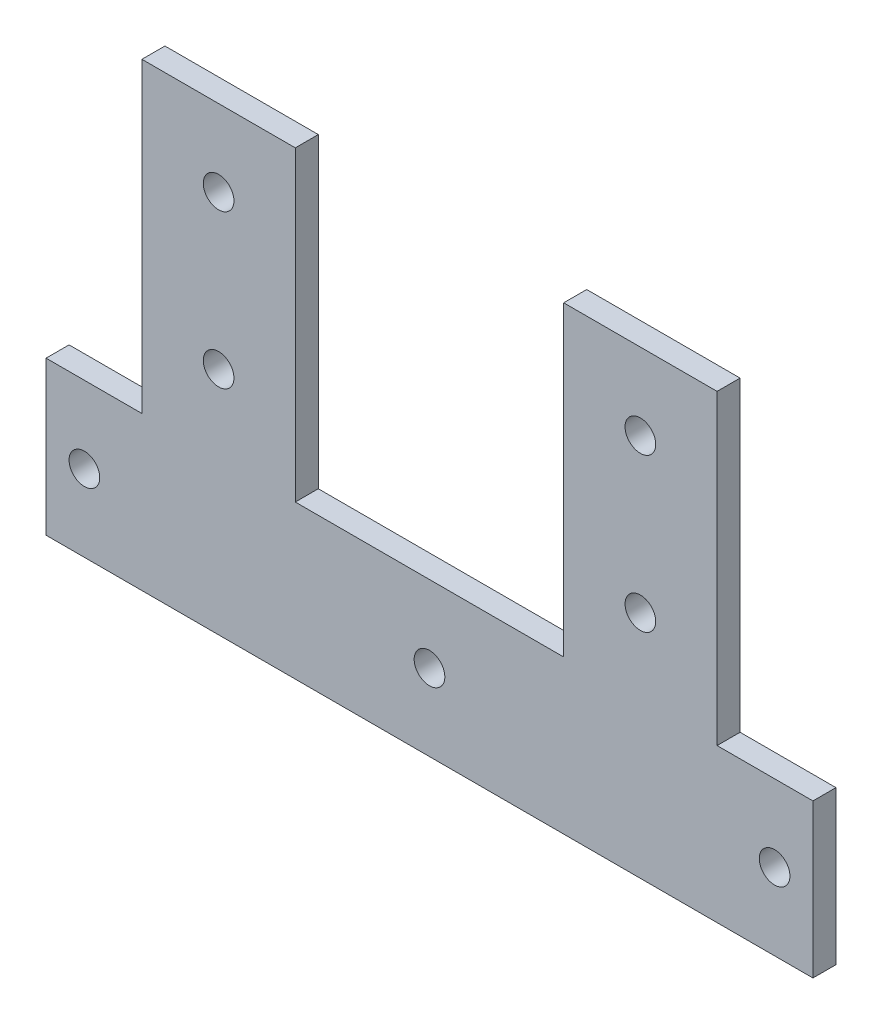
ISO-10303-21;
HEADER;
FILE_DESCRIPTION(('STEP AP214'),'2;1');
FILE_NAME('part.step','',(''),(''),'','','');
FILE_SCHEMA(('AUTOMOTIVE_DESIGN { 1 0 10303 214 1 1 1 1 }'));
ENDSEC;
DATA;
#1=APPLICATION_CONTEXT('core data for automotive mechanical design processes');
#2=APPLICATION_PROTOCOL_DEFINITION('international standard','automotive_design',2000,#1);
#3=PRODUCT_CONTEXT('',#1,'mechanical');
#4=PRODUCT('Part','Part','',(#3));
#5=PRODUCT_RELATED_PRODUCT_CATEGORY('part','',(#4));
#6=PRODUCT_DEFINITION_FORMATION('','',#4);
#7=PRODUCT_DEFINITION_CONTEXT('part definition',#1,'design');
#8=PRODUCT_DEFINITION('design','',#6,#7);
#9=PRODUCT_DEFINITION_SHAPE('','',#8);
#10=(LENGTH_UNIT() NAMED_UNIT(*) SI_UNIT(.MILLI.,.METRE.));
#11=(NAMED_UNIT(*) PLANE_ANGLE_UNIT() SI_UNIT($,.RADIAN.));
#12=(NAMED_UNIT(*) SI_UNIT($,.STERADIAN.) SOLID_ANGLE_UNIT());
#13=UNCERTAINTY_MEASURE_WITH_UNIT(LENGTH_MEASURE(1.E-05),#10,'distance_accuracy_value','');
#14=(GEOMETRIC_REPRESENTATION_CONTEXT(3) GLOBAL_UNCERTAINTY_ASSIGNED_CONTEXT((#13)) GLOBAL_UNIT_ASSIGNED_CONTEXT((#10,
#11,#12)) REPRESENTATION_CONTEXT('',''));
#15=CARTESIAN_POINT('',(0.,0.,0.));
#16=DIRECTION('',(0.,0.,1.));
#17=DIRECTION('',(1.,0.,0.));
#18=AXIS2_PLACEMENT_3D('',#15,#16,#17);
#19=CARTESIAN_POINT('',(50.,10.,3.));
#20=DIRECTION('',(-1.,0.,0.));
#21=DIRECTION('',(0.,0.,1.));
#22=AXIS2_PLACEMENT_3D('',#19,#20,#21);
#23=PLANE('',#22);
#24=DIRECTION('',(0.,1.,0.));
#25=VECTOR('',#24,1.);
#26=CARTESIAN_POINT('',(50.,10.,0.));
#27=LINE('',#26,#25);
#28=CARTESIAN_POINT('',(50.,-10.,0.));
#29=VERTEX_POINT('',#28);
#30=CARTESIAN_POINT('',(50.,10.,0.));
#31=VERTEX_POINT('',#30);
#32=EDGE_CURVE('E155',#29,#31,#27,.T.);
#33=ORIENTED_EDGE('',*,*,#32,.T.);
#34=DIRECTION('',(0.,0.,-1.));
#35=VECTOR('',#34,1.);
#36=CARTESIAN_POINT('',(50.,10.,3.));
#37=LINE('',#36,#35);
#38=CARTESIAN_POINT('',(50.,10.,3.));
#39=VERTEX_POINT('',#38);
#40=EDGE_CURVE('E11',#39,#31,#37,.T.);
#41=ORIENTED_EDGE('',*,*,#40,.F.);
#42=DIRECTION('',(0.,1.,0.));
#43=VECTOR('',#42,1.);
#44=CARTESIAN_POINT('',(50.,10.,3.));
#45=LINE('',#44,#43);
#46=CARTESIAN_POINT('',(50.,-10.,3.));
#47=VERTEX_POINT('',#46);
#48=EDGE_CURVE('E178',#47,#39,#45,.T.);
#49=ORIENTED_EDGE('',*,*,#48,.F.);
#50=DIRECTION('',(0.,0.,-1.));
#51=VECTOR('',#50,1.);
#52=CARTESIAN_POINT('',(50.,-10.,3.));
#53=LINE('',#52,#51);
#54=EDGE_CURVE('E151',#47,#29,#53,.T.);
#55=ORIENTED_EDGE('',*,*,#54,.T.);
#56=EDGE_LOOP('',(#33,#41,#49,#55));
#57=FACE_BOUND('',#56,.T.);
#58=ADVANCED_FACE('F35',(#57),#23,.F.);
#59=CARTESIAN_POINT('',(37.5,10.,3.));
#60=DIRECTION('',(0.,-1.,0.));
#61=DIRECTION('',(1.,0.,0.));
#62=AXIS2_PLACEMENT_3D('',#59,#60,#61);
#63=PLANE('',#62);
#64=DIRECTION('',(-1.,0.,0.));
#65=VECTOR('',#64,1.);
#66=CARTESIAN_POINT('',(37.5,10.,0.));
#67=LINE('',#66,#65);
#68=CARTESIAN_POINT('',(37.5,10.,0.));
#69=VERTEX_POINT('',#68);
#70=EDGE_CURVE('E158',#31,#69,#67,.T.);
#71=ORIENTED_EDGE('',*,*,#70,.T.);
#72=DIRECTION('',(0.,0.,-1.));
#73=VECTOR('',#72,1.);
#74=CARTESIAN_POINT('',(37.5,10.,3.));
#75=LINE('',#74,#73);
#76=CARTESIAN_POINT('',(37.5,10.,3.));
#77=VERTEX_POINT('',#76);
#78=EDGE_CURVE('E43',#77,#69,#75,.T.);
#79=ORIENTED_EDGE('',*,*,#78,.F.);
#80=DIRECTION('',(-1.,0.,0.));
#81=VECTOR('',#80,1.);
#82=CARTESIAN_POINT('',(37.5,10.,3.));
#83=LINE('',#82,#81);
#84=EDGE_CURVE('E106',#39,#77,#83,.T.);
#85=ORIENTED_EDGE('',*,*,#84,.F.);
#86=ORIENTED_EDGE('',*,*,#40,.T.);
#87=EDGE_LOOP('',(#71,#79,#85,#86));
#88=FACE_BOUND('',#87,.T.);
#89=ADVANCED_FACE('F257',(#88),#63,.F.);
#90=CARTESIAN_POINT('',(37.5,50.,3.));
#91=DIRECTION('',(-1.,0.,0.));
#92=DIRECTION('',(0.,-1.,0.));
#93=AXIS2_PLACEMENT_3D('',#90,#91,#92);
#94=PLANE('',#93);
#95=DIRECTION('',(0.,1.,0.));
#96=VECTOR('',#95,1.);
#97=CARTESIAN_POINT('',(37.5,50.,0.));
#98=LINE('',#97,#96);
#99=CARTESIAN_POINT('',(37.5,50.,0.));
#100=VERTEX_POINT('',#99);
#101=EDGE_CURVE('E161',#69,#100,#98,.T.);
#102=ORIENTED_EDGE('',*,*,#101,.T.);
#103=DIRECTION('',(0.,0.,-1.));
#104=VECTOR('',#103,1.);
#105=CARTESIAN_POINT('',(37.5,50.,3.));
#106=LINE('',#105,#104);
#107=CARTESIAN_POINT('',(37.5,50.,3.));
#108=VERTEX_POINT('',#107);
#109=EDGE_CURVE('E197',#108,#100,#106,.T.);
#110=ORIENTED_EDGE('',*,*,#109,.F.);
#111=DIRECTION('',(0.,1.,0.));
#112=VECTOR('',#111,1.);
#113=CARTESIAN_POINT('',(37.5,50.,3.));
#114=LINE('',#113,#112);
#115=EDGE_CURVE('E205',#77,#108,#114,.T.);
#116=ORIENTED_EDGE('',*,*,#115,.F.);
#117=ORIENTED_EDGE('',*,*,#78,.T.);
#118=EDGE_LOOP('',(#102,#110,#116,#117));
#119=FACE_BOUND('',#118,.T.);
#120=ADVANCED_FACE('F203',(#119),#94,.F.);
#121=CARTESIAN_POINT('',(17.5,50.,3.));
#122=DIRECTION('',(0.,-1.,0.));
#123=DIRECTION('',(0.,0.,-1.));
#124=AXIS2_PLACEMENT_3D('',#121,#122,#123);
#125=PLANE('',#124);
#126=DIRECTION('',(-1.,0.,0.));
#127=VECTOR('',#126,1.);
#128=CARTESIAN_POINT('',(17.5,50.,0.));
#129=LINE('',#128,#127);
#130=CARTESIAN_POINT('',(17.5,50.,0.));
#131=VERTEX_POINT('',#130);
#132=EDGE_CURVE('E163',#100,#131,#129,.T.);
#133=ORIENTED_EDGE('',*,*,#132,.T.);
#134=DIRECTION('',(0.,0.,-1.));
#135=VECTOR('',#134,1.);
#136=CARTESIAN_POINT('',(17.5,50.,3.));
#137=LINE('',#136,#135);
#138=CARTESIAN_POINT('',(17.5,50.,3.));
#139=VERTEX_POINT('',#138);
#140=EDGE_CURVE('E194',#139,#131,#137,.T.);
#141=ORIENTED_EDGE('',*,*,#140,.F.);
#142=DIRECTION('',(-1.,0.,0.));
#143=VECTOR('',#142,1.);
#144=CARTESIAN_POINT('',(17.5,50.,3.));
#145=LINE('',#144,#143);
#146=EDGE_CURVE('E223',#108,#139,#145,.T.);
#147=ORIENTED_EDGE('',*,*,#146,.F.);
#148=ORIENTED_EDGE('',*,*,#109,.T.);
#149=EDGE_LOOP('',(#133,#141,#147,#148));
#150=FACE_BOUND('',#149,.T.);
#151=ADVANCED_FACE('F214',(#150),#125,.F.);
#152=CARTESIAN_POINT('',(17.5,10.,3.));
#153=DIRECTION('',(1.,0.,0.));
#154=DIRECTION('',(0.,0.,-1.));
#155=AXIS2_PLACEMENT_3D('',#152,#153,#154);
#156=PLANE('',#155);
#157=DIRECTION('',(0.,-1.,0.));
#158=VECTOR('',#157,1.);
#159=CARTESIAN_POINT('',(17.5,10.,0.));
#160=LINE('',#159,#158);
#161=CARTESIAN_POINT('',(17.5,10.,0.));
#162=VERTEX_POINT('',#161);
#163=EDGE_CURVE('E165',#131,#162,#160,.T.);
#164=ORIENTED_EDGE('',*,*,#163,.T.);
#165=DIRECTION('',(0.,0.,-1.));
#166=VECTOR('',#165,1.);
#167=CARTESIAN_POINT('',(17.5,10.,3.));
#168=LINE('',#167,#166);
#169=CARTESIAN_POINT('',(17.5,10.,3.));
#170=VERTEX_POINT('',#169);
#171=EDGE_CURVE('E191',#170,#162,#168,.T.);
#172=ORIENTED_EDGE('',*,*,#171,.F.);
#173=DIRECTION('',(0.,-1.,0.));
#174=VECTOR('',#173,1.);
#175=CARTESIAN_POINT('',(17.5,10.,3.));
#176=LINE('',#175,#174);
#177=EDGE_CURVE('E220',#139,#170,#176,.T.);
#178=ORIENTED_EDGE('',*,*,#177,.F.);
#179=ORIENTED_EDGE('',*,*,#140,.T.);
#180=EDGE_LOOP('',(#164,#172,#178,#179));
#181=FACE_BOUND('',#180,.T.);
#182=ADVANCED_FACE('F218',(#181),#156,.F.);
#183=CARTESIAN_POINT('',(-17.5,10.,3.));
#184=DIRECTION('',(0.,-1.,0.));
#185=DIRECTION('',(0.,0.,-1.));
#186=AXIS2_PLACEMENT_3D('',#183,#184,#185);
#187=PLANE('',#186);
#188=DIRECTION('',(-1.,0.,0.));
#189=VECTOR('',#188,1.);
#190=CARTESIAN_POINT('',(-17.5,10.,0.));
#191=LINE('',#190,#189);
#192=CARTESIAN_POINT('',(-17.5,10.,0.));
#193=VERTEX_POINT('',#192);
#194=EDGE_CURVE('E167',#162,#193,#191,.T.);
#195=ORIENTED_EDGE('',*,*,#194,.T.);
#196=DIRECTION('',(0.,0.,-1.));
#197=VECTOR('',#196,1.);
#198=CARTESIAN_POINT('',(-17.5,10.,3.));
#199=LINE('',#198,#197);
#200=CARTESIAN_POINT('',(-17.5,10.,3.));
#201=VERTEX_POINT('',#200);
#202=EDGE_CURVE('E188',#201,#193,#199,.T.);
#203=ORIENTED_EDGE('',*,*,#202,.F.);
#204=DIRECTION('',(-1.,0.,0.));
#205=VECTOR('',#204,1.);
#206=CARTESIAN_POINT('',(-17.5,10.,3.));
#207=LINE('',#206,#205);
#208=EDGE_CURVE('E222',#170,#201,#207,.T.);
#209=ORIENTED_EDGE('',*,*,#208,.F.);
#210=ORIENTED_EDGE('',*,*,#171,.T.);
#211=EDGE_LOOP('',(#195,#203,#209,#210));
#212=FACE_BOUND('',#211,.T.);
#213=ADVANCED_FACE('F270',(#212),#187,.F.);
#214=CARTESIAN_POINT('',(-17.5,50.,3.));
#215=DIRECTION('',(-1.,0.,0.));
#216=DIRECTION('',(0.,-1.,0.));
#217=AXIS2_PLACEMENT_3D('',#214,#215,#216);
#218=PLANE('',#217);
#219=DIRECTION('',(0.,1.,0.));
#220=VECTOR('',#219,1.);
#221=CARTESIAN_POINT('',(-17.5,50.,0.));
#222=LINE('',#221,#220);
#223=CARTESIAN_POINT('',(-17.5,50.,0.));
#224=VERTEX_POINT('',#223);
#225=EDGE_CURVE('E169',#193,#224,#222,.T.);
#226=ORIENTED_EDGE('',*,*,#225,.T.);
#227=DIRECTION('',(0.,0.,-1.));
#228=VECTOR('',#227,1.);
#229=CARTESIAN_POINT('',(-17.5,50.,3.));
#230=LINE('',#229,#228);
#231=CARTESIAN_POINT('',(-17.5,50.,3.));
#232=VERTEX_POINT('',#231);
#233=EDGE_CURVE('E185',#232,#224,#230,.T.);
#234=ORIENTED_EDGE('',*,*,#233,.F.);
#235=DIRECTION('',(0.,1.,0.));
#236=VECTOR('',#235,1.);
#237=CARTESIAN_POINT('',(-17.5,50.,3.));
#238=LINE('',#237,#236);
#239=EDGE_CURVE('E225',#201,#232,#238,.T.);
#240=ORIENTED_EDGE('',*,*,#239,.F.);
#241=ORIENTED_EDGE('',*,*,#202,.T.);
#242=EDGE_LOOP('',(#226,#234,#240,#241));
#243=FACE_BOUND('',#242,.T.);
#244=ADVANCED_FACE('F273',(#243),#218,.F.);
#245=CARTESIAN_POINT('',(-37.5,50.,3.));
#246=DIRECTION('',(0.,-1.,0.));
#247=DIRECTION('',(0.,0.,-1.));
#248=AXIS2_PLACEMENT_3D('',#245,#246,#247);
#249=PLANE('',#248);
#250=DIRECTION('',(-1.,0.,0.));
#251=VECTOR('',#250,1.);
#252=CARTESIAN_POINT('',(-37.5,50.,0.));
#253=LINE('',#252,#251);
#254=CARTESIAN_POINT('',(-37.5,50.,0.));
#255=VERTEX_POINT('',#254);
#256=EDGE_CURVE('E171',#224,#255,#253,.T.);
#257=ORIENTED_EDGE('',*,*,#256,.T.);
#258=DIRECTION('',(0.,0.,-1.));
#259=VECTOR('',#258,1.);
#260=CARTESIAN_POINT('',(-37.5,50.,3.));
#261=LINE('',#260,#259);
#262=CARTESIAN_POINT('',(-37.5,50.,3.));
#263=VERTEX_POINT('',#262);
#264=EDGE_CURVE('E182',#263,#255,#261,.T.);
#265=ORIENTED_EDGE('',*,*,#264,.F.);
#266=DIRECTION('',(-1.,0.,0.));
#267=VECTOR('',#266,1.);
#268=CARTESIAN_POINT('',(-37.5,50.,3.));
#269=LINE('',#268,#267);
#270=EDGE_CURVE('E231',#232,#263,#269,.T.);
#271=ORIENTED_EDGE('',*,*,#270,.F.);
#272=ORIENTED_EDGE('',*,*,#233,.T.);
#273=EDGE_LOOP('',(#257,#265,#271,#272));
#274=FACE_BOUND('',#273,.T.);
#275=ADVANCED_FACE('F237',(#274),#249,.F.);
#276=CARTESIAN_POINT('',(-37.5,10.,3.));
#277=DIRECTION('',(1.,0.,0.));
#278=DIRECTION('',(0.,0.,-1.));
#279=AXIS2_PLACEMENT_3D('',#276,#277,#278);
#280=PLANE('',#279);
#281=DIRECTION('',(0.,-1.,0.));
#282=VECTOR('',#281,1.);
#283=CARTESIAN_POINT('',(-37.5,10.,0.));
#284=LINE('',#283,#282);
#285=CARTESIAN_POINT('',(-37.5,10.,0.));
#286=VERTEX_POINT('',#285);
#287=EDGE_CURVE('E173',#255,#286,#284,.T.);
#288=ORIENTED_EDGE('',*,*,#287,.T.);
#289=DIRECTION('',(0.,0.,-1.));
#290=VECTOR('',#289,1.);
#291=CARTESIAN_POINT('',(-37.5,10.,3.));
#292=LINE('',#291,#290);
#293=CARTESIAN_POINT('',(-37.5,10.,3.));
#294=VERTEX_POINT('',#293);
#295=EDGE_CURVE('E146',#294,#286,#292,.T.);
#296=ORIENTED_EDGE('',*,*,#295,.F.);
#297=DIRECTION('',(0.,-1.,0.));
#298=VECTOR('',#297,1.);
#299=CARTESIAN_POINT('',(-37.5,10.,3.));
#300=LINE('',#299,#298);
#301=EDGE_CURVE('E137',#263,#294,#300,.T.);
#302=ORIENTED_EDGE('',*,*,#301,.F.);
#303=ORIENTED_EDGE('',*,*,#264,.T.);
#304=EDGE_LOOP('',(#288,#296,#302,#303));
#305=FACE_BOUND('',#304,.T.);
#306=ADVANCED_FACE('F241',(#305),#280,.F.);
#307=CARTESIAN_POINT('',(-50.,10.,3.));
#308=DIRECTION('',(0.,-1.,0.));
#309=DIRECTION('',(0.,0.,-1.));
#310=AXIS2_PLACEMENT_3D('',#307,#308,#309);
#311=PLANE('',#310);
#312=DIRECTION('',(-1.,0.,0.));
#313=VECTOR('',#312,1.);
#314=CARTESIAN_POINT('',(-50.,10.,0.));
#315=LINE('',#314,#313);
#316=CARTESIAN_POINT('',(-50.,10.,0.));
#317=VERTEX_POINT('',#316);
#318=EDGE_CURVE('E145',#286,#317,#315,.T.);
#319=ORIENTED_EDGE('',*,*,#318,.T.);
#320=DIRECTION('',(0.,0.,-1.));
#321=VECTOR('',#320,1.);
#322=CARTESIAN_POINT('',(-50.,10.,3.));
#323=LINE('',#322,#321);
#324=CARTESIAN_POINT('',(-50.,10.,3.));
#325=VERTEX_POINT('',#324);
#326=EDGE_CURVE('E142',#325,#317,#323,.T.);
#327=ORIENTED_EDGE('',*,*,#326,.F.);
#328=DIRECTION('',(-1.,0.,0.));
#329=VECTOR('',#328,1.);
#330=CARTESIAN_POINT('',(-50.,10.,3.));
#331=LINE('',#330,#329);
#332=EDGE_CURVE('E131',#294,#325,#331,.T.);
#333=ORIENTED_EDGE('',*,*,#332,.F.);
#334=ORIENTED_EDGE('',*,*,#295,.T.);
#335=EDGE_LOOP('',(#319,#327,#333,#334));
#336=FACE_BOUND('',#335,.T.);
#337=ADVANCED_FACE('F143',(#336),#311,.F.);
#338=CARTESIAN_POINT('',(-50.,10.,3.));
#339=DIRECTION('',(1.,0.,0.));
#340=DIRECTION('',(0.,0.,-1.));
#341=AXIS2_PLACEMENT_3D('',#338,#339,#340);
#342=PLANE('',#341);
#343=DIRECTION('',(0.,-1.,0.));
#344=VECTOR('',#343,1.);
#345=CARTESIAN_POINT('',(-50.,10.,0.));
#346=LINE('',#345,#344);
#347=CARTESIAN_POINT('',(-50.,-10.,0.));
#348=VERTEX_POINT('',#347);
#349=EDGE_CURVE('E92',#317,#348,#346,.T.);
#350=ORIENTED_EDGE('',*,*,#349,.T.);
#351=DIRECTION('',(0.,0.,-1.));
#352=VECTOR('',#351,1.);
#353=CARTESIAN_POINT('',(-50.,-10.,3.));
#354=LINE('',#353,#352);
#355=CARTESIAN_POINT('',(-50.,-10.,3.));
#356=VERTEX_POINT('',#355);
#357=EDGE_CURVE('E147',#356,#348,#354,.T.);
#358=ORIENTED_EDGE('',*,*,#357,.F.);
#359=DIRECTION('',(0.,-1.,0.));
#360=VECTOR('',#359,1.);
#361=CARTESIAN_POINT('',(-50.,10.,3.));
#362=LINE('',#361,#360);
#363=EDGE_CURVE('E135',#325,#356,#362,.T.);
#364=ORIENTED_EDGE('',*,*,#363,.F.);
#365=ORIENTED_EDGE('',*,*,#326,.T.);
#366=EDGE_LOOP('',(#350,#358,#364,#365));
#367=FACE_BOUND('',#366,.T.);
#368=ADVANCED_FACE('F149',(#367),#342,.F.);
#369=CARTESIAN_POINT('',(-50.,-10.,3.));
#370=DIRECTION('',(0.,1.,0.));
#371=DIRECTION('',(0.,0.,1.));
#372=AXIS2_PLACEMENT_3D('',#369,#370,#371);
#373=PLANE('',#372);
#374=DIRECTION('',(1.,0.,0.));
#375=VECTOR('',#374,1.);
#376=CARTESIAN_POINT('',(-50.,-10.,0.));
#377=LINE('',#376,#375);
#378=EDGE_CURVE('E98',#348,#29,#377,.T.);
#379=ORIENTED_EDGE('',*,*,#378,.T.);
#380=ORIENTED_EDGE('',*,*,#54,.F.);
#381=DIRECTION('',(1.,0.,0.));
#382=VECTOR('',#381,1.);
#383=CARTESIAN_POINT('',(-50.,-10.,3.));
#384=LINE('',#383,#382);
#385=EDGE_CURVE('E51',#356,#47,#384,.T.);
#386=ORIENTED_EDGE('',*,*,#385,.F.);
#387=ORIENTED_EDGE('',*,*,#357,.T.);
#388=EDGE_LOOP('',(#379,#380,#386,#387));
#389=FACE_BOUND('',#388,.T.);
#390=ADVANCED_FACE('F245',(#389),#373,.F.);
#391=CARTESIAN_POINT('',(0.,0.,3.));
#392=DIRECTION('',(0.,0.,1.));
#393=DIRECTION('',(1.,0.,0.));
#394=AXIS2_PLACEMENT_3D('',#391,#392,#393);
#395=PLANE('',#394);
#396=CARTESIAN_POINT('',(27.5,40.,3.));
#397=DIRECTION('',(0.,0.,1.));
#398=DIRECTION('',(1.,0.,0.));
#399=AXIS2_PLACEMENT_3D('',#396,#397,#398);
#400=CIRCLE('',#399,1.99999999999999);
#401=CARTESIAN_POINT('',(29.5,40.,3.));
#402=VERTEX_POINT('',#401);
#403=EDGE_CURVE('E389',#402,#402,#400,.T.);
#404=ORIENTED_EDGE('',*,*,#403,.F.);
#405=EDGE_LOOP('',(#404));
#406=FACE_BOUND('',#405,.T.);
#407=CARTESIAN_POINT('',(27.5,20.,3.));
#408=DIRECTION('',(0.,0.,1.));
#409=DIRECTION('',(1.,0.,0.));
#410=AXIS2_PLACEMENT_3D('',#407,#408,#409);
#411=CIRCLE('',#410,1.99999999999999);
#412=CARTESIAN_POINT('',(29.5,20.,3.));
#413=VERTEX_POINT('',#412);
#414=EDGE_CURVE('E391',#413,#413,#411,.T.);
#415=ORIENTED_EDGE('',*,*,#414,.F.);
#416=EDGE_LOOP('',(#415));
#417=FACE_BOUND('',#416,.T.);
#418=CARTESIAN_POINT('',(0.,0.,3.));
#419=DIRECTION('',(0.,0.,1.));
#420=DIRECTION('',(1.,0.,0.));
#421=AXIS2_PLACEMENT_3D('',#418,#419,#420);
#422=CIRCLE('',#421,1.99999999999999);
#423=CARTESIAN_POINT('',(1.99999999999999,0.,3.));
#424=VERTEX_POINT('',#423);
#425=EDGE_CURVE('E399',#424,#424,#422,.T.);
#426=ORIENTED_EDGE('',*,*,#425,.F.);
#427=EDGE_LOOP('',(#426));
#428=FACE_BOUND('',#427,.T.);
#429=CARTESIAN_POINT('',(-27.5,40.,3.));
#430=DIRECTION('',(0.,0.,1.));
#431=DIRECTION('',(1.,0.,0.));
#432=AXIS2_PLACEMENT_3D('',#429,#430,#431);
#433=CIRCLE('',#432,1.99999999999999);
#434=CARTESIAN_POINT('',(-25.5,40.,3.));
#435=VERTEX_POINT('',#434);
#436=EDGE_CURVE('E405',#435,#435,#433,.T.);
#437=ORIENTED_EDGE('',*,*,#436,.F.);
#438=EDGE_LOOP('',(#437));
#439=FACE_BOUND('',#438,.T.);
#440=CARTESIAN_POINT('',(-27.5,20.,3.));
#441=DIRECTION('',(0.,0.,1.));
#442=DIRECTION('',(1.,0.,0.));
#443=AXIS2_PLACEMENT_3D('',#440,#441,#442);
#444=CIRCLE('',#443,1.99999999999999);
#445=CARTESIAN_POINT('',(-25.5,20.,3.));
#446=VERTEX_POINT('',#445);
#447=EDGE_CURVE('E411',#446,#446,#444,.T.);
#448=ORIENTED_EDGE('',*,*,#447,.F.);
#449=EDGE_LOOP('',(#448));
#450=FACE_BOUND('',#449,.T.);
#451=CARTESIAN_POINT('',(-45.,0.,3.));
#452=DIRECTION('',(0.,0.,1.));
#453=DIRECTION('',(1.,0.,0.));
#454=AXIS2_PLACEMENT_3D('',#451,#452,#453);
#455=CIRCLE('',#454,1.99999999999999);
#456=CARTESIAN_POINT('',(-43.,0.,3.));
#457=VERTEX_POINT('',#456);
#458=EDGE_CURVE('E417',#457,#457,#455,.T.);
#459=ORIENTED_EDGE('',*,*,#458,.F.);
#460=EDGE_LOOP('',(#459));
#461=FACE_BOUND('',#460,.T.);
#462=CARTESIAN_POINT('',(45.,0.,3.));
#463=DIRECTION('',(0.,0.,1.));
#464=DIRECTION('',(1.,0.,0.));
#465=AXIS2_PLACEMENT_3D('',#462,#463,#464);
#466=CIRCLE('',#465,1.99999999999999);
#467=CARTESIAN_POINT('',(47.,0.,3.));
#468=VERTEX_POINT('',#467);
#469=EDGE_CURVE('E423',#468,#468,#466,.T.);
#470=ORIENTED_EDGE('',*,*,#469,.F.);
#471=EDGE_LOOP('',(#470));
#472=FACE_BOUND('',#471,.T.);
#473=ORIENTED_EDGE('',*,*,#48,.T.);
#474=ORIENTED_EDGE('',*,*,#84,.T.);
#475=ORIENTED_EDGE('',*,*,#115,.T.);
#476=ORIENTED_EDGE('',*,*,#146,.T.);
#477=ORIENTED_EDGE('',*,*,#177,.T.);
#478=ORIENTED_EDGE('',*,*,#208,.T.);
#479=ORIENTED_EDGE('',*,*,#239,.T.);
#480=ORIENTED_EDGE('',*,*,#270,.T.);
#481=ORIENTED_EDGE('',*,*,#301,.T.);
#482=ORIENTED_EDGE('',*,*,#332,.T.);
#483=ORIENTED_EDGE('',*,*,#363,.T.);
#484=ORIENTED_EDGE('',*,*,#385,.T.);
#485=EDGE_LOOP('',(#473,#474,#475,#476,#477,#478,#479,#480,#481,#482,#483,#484));
#486=FACE_BOUND('',#485,.T.);
#487=ADVANCED_FACE('F133',(#406,#417,#428,#439,#450,#461,#472,#486),#395,.T.);
#488=CARTESIAN_POINT('',(0.,0.,0.));
#489=DIRECTION('',(0.,0.,1.));
#490=DIRECTION('',(1.,0.,0.));
#491=AXIS2_PLACEMENT_3D('',#488,#489,#490);
#492=PLANE('',#491);
#493=CARTESIAN_POINT('',(27.5,40.,0.));
#494=DIRECTION('',(0.,0.,1.));
#495=DIRECTION('',(1.,0.,0.));
#496=AXIS2_PLACEMENT_3D('',#493,#494,#495);
#497=CIRCLE('',#496,2.);
#498=CARTESIAN_POINT('',(29.5,40.,0.));
#499=VERTEX_POINT('',#498);
#500=EDGE_CURVE('E386',#499,#499,#497,.T.);
#501=ORIENTED_EDGE('',*,*,#500,.T.);
#502=EDGE_LOOP('',(#501));
#503=FACE_BOUND('',#502,.T.);
#504=CARTESIAN_POINT('',(27.5,20.,0.));
#505=DIRECTION('',(0.,0.,1.));
#506=DIRECTION('',(1.,0.,0.));
#507=AXIS2_PLACEMENT_3D('',#504,#505,#506);
#508=CIRCLE('',#507,2.);
#509=CARTESIAN_POINT('',(29.5,20.,0.));
#510=VERTEX_POINT('',#509);
#511=EDGE_CURVE('E396',#510,#510,#508,.T.);
#512=ORIENTED_EDGE('',*,*,#511,.T.);
#513=EDGE_LOOP('',(#512));
#514=FACE_BOUND('',#513,.T.);
#515=CARTESIAN_POINT('',(0.,0.,0.));
#516=DIRECTION('',(0.,0.,1.));
#517=DIRECTION('',(1.,0.,0.));
#518=AXIS2_PLACEMENT_3D('',#515,#516,#517);
#519=CIRCLE('',#518,2.);
#520=CARTESIAN_POINT('',(2.,0.,0.));
#521=VERTEX_POINT('',#520);
#522=EDGE_CURVE('E402',#521,#521,#519,.T.);
#523=ORIENTED_EDGE('',*,*,#522,.T.);
#524=EDGE_LOOP('',(#523));
#525=FACE_BOUND('',#524,.T.);
#526=CARTESIAN_POINT('',(-27.5,40.,0.));
#527=DIRECTION('',(0.,0.,1.));
#528=DIRECTION('',(1.,0.,0.));
#529=AXIS2_PLACEMENT_3D('',#526,#527,#528);
#530=CIRCLE('',#529,2.);
#531=CARTESIAN_POINT('',(-25.5,40.,0.));
#532=VERTEX_POINT('',#531);
#533=EDGE_CURVE('E408',#532,#532,#530,.T.);
#534=ORIENTED_EDGE('',*,*,#533,.T.);
#535=EDGE_LOOP('',(#534));
#536=FACE_BOUND('',#535,.T.);
#537=CARTESIAN_POINT('',(-27.5,20.,0.));
#538=DIRECTION('',(0.,0.,1.));
#539=DIRECTION('',(1.,0.,0.));
#540=AXIS2_PLACEMENT_3D('',#537,#538,#539);
#541=CIRCLE('',#540,2.);
#542=CARTESIAN_POINT('',(-25.5,20.,0.));
#543=VERTEX_POINT('',#542);
#544=EDGE_CURVE('E414',#543,#543,#541,.T.);
#545=ORIENTED_EDGE('',*,*,#544,.T.);
#546=EDGE_LOOP('',(#545));
#547=FACE_BOUND('',#546,.T.);
#548=CARTESIAN_POINT('',(-45.,0.,0.));
#549=DIRECTION('',(0.,0.,1.));
#550=DIRECTION('',(1.,0.,0.));
#551=AXIS2_PLACEMENT_3D('',#548,#549,#550);
#552=CIRCLE('',#551,1.99999999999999);
#553=CARTESIAN_POINT('',(-43.,0.,0.));
#554=VERTEX_POINT('',#553);
#555=EDGE_CURVE('E420',#554,#554,#552,.T.);
#556=ORIENTED_EDGE('',*,*,#555,.T.);
#557=EDGE_LOOP('',(#556));
#558=FACE_BOUND('',#557,.T.);
#559=CARTESIAN_POINT('',(45.,0.,0.));
#560=DIRECTION('',(0.,0.,1.));
#561=DIRECTION('',(1.,0.,0.));
#562=AXIS2_PLACEMENT_3D('',#559,#560,#561);
#563=CIRCLE('',#562,1.99999999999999);
#564=CARTESIAN_POINT('',(47.,0.,0.));
#565=VERTEX_POINT('',#564);
#566=EDGE_CURVE('E159',#565,#565,#563,.T.);
#567=ORIENTED_EDGE('',*,*,#566,.T.);
#568=EDGE_LOOP('',(#567));
#569=FACE_BOUND('',#568,.T.);
#570=ORIENTED_EDGE('',*,*,#32,.F.);
#571=ORIENTED_EDGE('',*,*,#378,.F.);
#572=ORIENTED_EDGE('',*,*,#349,.F.);
#573=ORIENTED_EDGE('',*,*,#318,.F.);
#574=ORIENTED_EDGE('',*,*,#287,.F.);
#575=ORIENTED_EDGE('',*,*,#256,.F.);
#576=ORIENTED_EDGE('',*,*,#225,.F.);
#577=ORIENTED_EDGE('',*,*,#194,.F.);
#578=ORIENTED_EDGE('',*,*,#163,.F.);
#579=ORIENTED_EDGE('',*,*,#132,.F.);
#580=ORIENTED_EDGE('',*,*,#101,.F.);
#581=ORIENTED_EDGE('',*,*,#70,.F.);
#582=EDGE_LOOP('',(#570,#571,#572,#573,#574,#575,#576,#577,#578,#579,#580,#581));
#583=FACE_BOUND('',#582,.T.);
#584=ADVANCED_FACE('F209',(#503,#514,#525,#536,#547,#558,#569,#583),#492,.F.);
#585=CARTESIAN_POINT('',(45.,0.,3.));
#586=DIRECTION('',(0.,0.,1.));
#587=DIRECTION('',(1.,0.,0.));
#588=AXIS2_PLACEMENT_3D('',#585,#586,#587);
#589=CYLINDRICAL_SURFACE('',#588,1.99999999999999);
#590=ORIENTED_EDGE('',*,*,#566,.F.);
#591=EDGE_LOOP('',(#590));
#592=FACE_BOUND('',#591,.T.);
#593=ORIENTED_EDGE('',*,*,#469,.T.);
#594=EDGE_LOOP('',(#593));
#595=FACE_BOUND('',#594,.T.);
#596=ADVANCED_FACE('F310',(#592,#595),#589,.F.);
#597=CARTESIAN_POINT('',(-45.,0.,3.));
#598=DIRECTION('',(0.,0.,1.));
#599=DIRECTION('',(1.,0.,0.));
#600=AXIS2_PLACEMENT_3D('',#597,#598,#599);
#601=CYLINDRICAL_SURFACE('',#600,1.99999999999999);
#602=ORIENTED_EDGE('',*,*,#555,.F.);
#603=EDGE_LOOP('',(#602));
#604=FACE_BOUND('',#603,.T.);
#605=ORIENTED_EDGE('',*,*,#458,.T.);
#606=EDGE_LOOP('',(#605));
#607=FACE_BOUND('',#606,.T.);
#608=ADVANCED_FACE('F319',(#604,#607),#601,.F.);
#609=CARTESIAN_POINT('',(-27.5,20.,3.));
#610=DIRECTION('',(0.,0.,1.));
#611=DIRECTION('',(1.,0.,0.));
#612=AXIS2_PLACEMENT_3D('',#609,#610,#611);
#613=CYLINDRICAL_SURFACE('',#612,1.99999999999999);
#614=ORIENTED_EDGE('',*,*,#544,.F.);
#615=EDGE_LOOP('',(#614));
#616=FACE_BOUND('',#615,.T.);
#617=ORIENTED_EDGE('',*,*,#447,.T.);
#618=EDGE_LOOP('',(#617));
#619=FACE_BOUND('',#618,.T.);
#620=ADVANCED_FACE('F329',(#616,#619),#613,.F.);
#621=CARTESIAN_POINT('',(-27.5,40.,3.));
#622=DIRECTION('',(0.,0.,1.));
#623=DIRECTION('',(1.,0.,0.));
#624=AXIS2_PLACEMENT_3D('',#621,#622,#623);
#625=CYLINDRICAL_SURFACE('',#624,1.99999999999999);
#626=ORIENTED_EDGE('',*,*,#533,.F.);
#627=EDGE_LOOP('',(#626));
#628=FACE_BOUND('',#627,.T.);
#629=ORIENTED_EDGE('',*,*,#436,.T.);
#630=EDGE_LOOP('',(#629));
#631=FACE_BOUND('',#630,.T.);
#632=ADVANCED_FACE('F339',(#628,#631),#625,.F.);
#633=CARTESIAN_POINT('',(0.,0.,3.));
#634=DIRECTION('',(0.,0.,1.));
#635=DIRECTION('',(1.,0.,0.));
#636=AXIS2_PLACEMENT_3D('',#633,#634,#635);
#637=CYLINDRICAL_SURFACE('',#636,1.99999999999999);
#638=ORIENTED_EDGE('',*,*,#522,.F.);
#639=EDGE_LOOP('',(#638));
#640=FACE_BOUND('',#639,.T.);
#641=ORIENTED_EDGE('',*,*,#425,.T.);
#642=EDGE_LOOP('',(#641));
#643=FACE_BOUND('',#642,.T.);
#644=ADVANCED_FACE('F349',(#640,#643),#637,.F.);
#645=CARTESIAN_POINT('',(27.5,20.,3.));
#646=DIRECTION('',(0.,0.,1.));
#647=DIRECTION('',(1.,0.,0.));
#648=AXIS2_PLACEMENT_3D('',#645,#646,#647);
#649=CYLINDRICAL_SURFACE('',#648,1.99999999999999);
#650=ORIENTED_EDGE('',*,*,#511,.F.);
#651=EDGE_LOOP('',(#650));
#652=FACE_BOUND('',#651,.T.);
#653=ORIENTED_EDGE('',*,*,#414,.T.);
#654=EDGE_LOOP('',(#653));
#655=FACE_BOUND('',#654,.T.);
#656=ADVANCED_FACE('F359',(#652,#655),#649,.F.);
#657=CARTESIAN_POINT('',(27.5,40.,3.));
#658=DIRECTION('',(0.,0.,1.));
#659=DIRECTION('',(1.,0.,0.));
#660=AXIS2_PLACEMENT_3D('',#657,#658,#659);
#661=CYLINDRICAL_SURFACE('',#660,1.99999999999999);
#662=ORIENTED_EDGE('',*,*,#500,.F.);
#663=EDGE_LOOP('',(#662));
#664=FACE_BOUND('',#663,.T.);
#665=ORIENTED_EDGE('',*,*,#403,.T.);
#666=EDGE_LOOP('',(#665));
#667=FACE_BOUND('',#666,.T.);
#668=ADVANCED_FACE('F369',(#664,#667),#661,.F.);
#669=CLOSED_SHELL('',(#58,#89,#120,#151,#182,#213,#244,#275,#306,#337,#368,#390,#487,#584,#596,
#608,#620,#632,#644,#656,#668));
#670=MANIFOLD_SOLID_BREP('B2',#669);
#671=ADVANCED_BREP_SHAPE_REPRESENTATION('',(#18,#670),#14);
#672=SHAPE_DEFINITION_REPRESENTATION(#9,#671);
ENDSEC;
END-ISO-10303-21;
